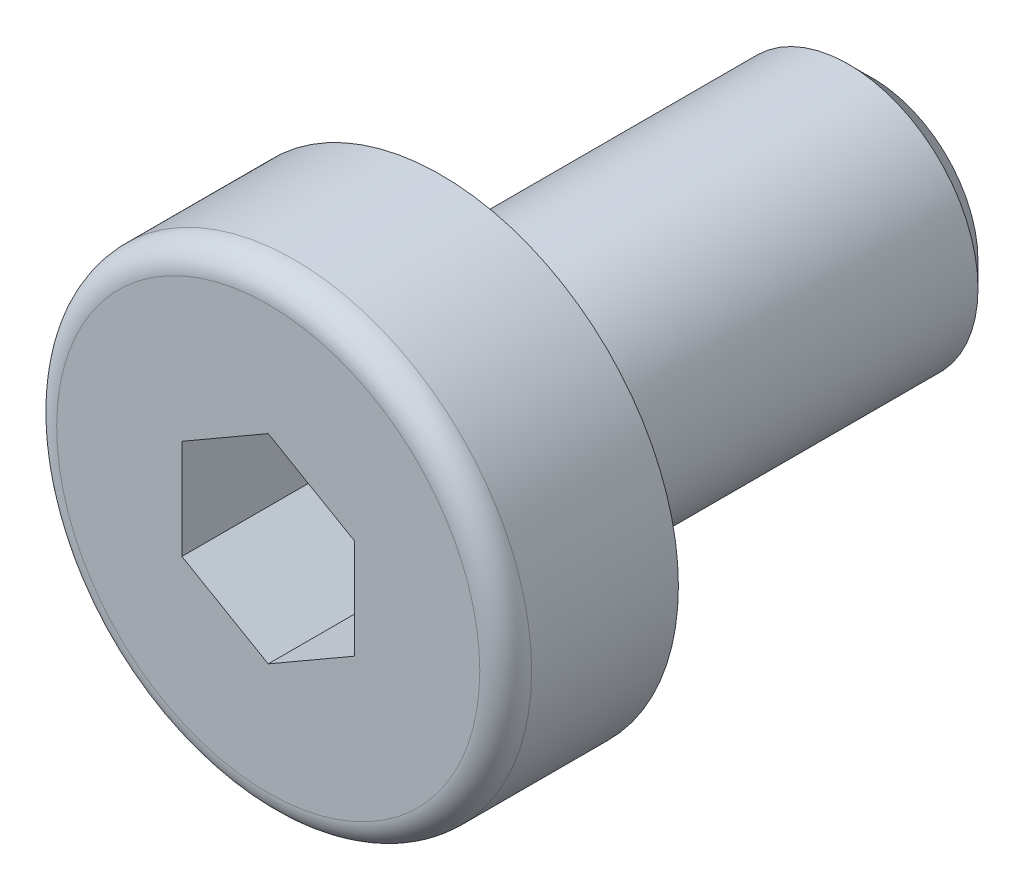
ISO-10303-21;
HEADER;
FILE_DESCRIPTION(('STEP AP214'),'2;1');
FILE_NAME('part.step','',(''),(''),'','','');
FILE_SCHEMA(('AUTOMOTIVE_DESIGN { 1 0 10303 214 1 1 1 1 }'));
ENDSEC;
DATA;
#1=APPLICATION_CONTEXT('core data for automotive mechanical design processes');
#2=APPLICATION_PROTOCOL_DEFINITION('international standard','automotive_design',2000,#1);
#3=PRODUCT_CONTEXT('',#1,'mechanical');
#4=PRODUCT('Part','Part','',(#3));
#5=PRODUCT_RELATED_PRODUCT_CATEGORY('part','',(#4));
#6=PRODUCT_DEFINITION_FORMATION('','',#4);
#7=PRODUCT_DEFINITION_CONTEXT('part definition',#1,'design');
#8=PRODUCT_DEFINITION('design','',#6,#7);
#9=PRODUCT_DEFINITION_SHAPE('','',#8);
#10=(LENGTH_UNIT() NAMED_UNIT(*) SI_UNIT(.MILLI.,.METRE.));
#11=(NAMED_UNIT(*) PLANE_ANGLE_UNIT() SI_UNIT($,.RADIAN.));
#12=(NAMED_UNIT(*) SI_UNIT($,.STERADIAN.) SOLID_ANGLE_UNIT());
#13=UNCERTAINTY_MEASURE_WITH_UNIT(LENGTH_MEASURE(1.E-05),#10,'distance_accuracy_value','');
#14=(GEOMETRIC_REPRESENTATION_CONTEXT(3) GLOBAL_UNCERTAINTY_ASSIGNED_CONTEXT((#13)) GLOBAL_UNIT_ASSIGNED_CONTEXT((#10,
#11,#12)) REPRESENTATION_CONTEXT('',''));
#15=CARTESIAN_POINT('',(0.,0.,0.));
#16=DIRECTION('',(0.,0.,1.));
#17=DIRECTION('',(1.,0.,0.));
#18=AXIS2_PLACEMENT_3D('',#15,#16,#17);
#19=CARTESIAN_POINT('',(56.0209250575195,73.9281135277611,11.9999999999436));
#20=DIRECTION('',(0.,0.,1.));
#21=DIRECTION('',(1.,0.,0.));
#22=AXIS2_PLACEMENT_3D('',#19,#20,#21);
#23=CONICAL_SURFACE('',#22,0.999999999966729,1.04719755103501);
#24=CARTESIAN_POINT('',(56.020925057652,73.9281135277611,11.422649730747));
#25=VERTEX_POINT('',#24);
#26=VERTEX_LOOP('',#25);
#27=FACE_BOUND('',#26,.T.);
#28=CARTESIAN_POINT('',(56.0209250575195,73.9281135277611,11.9999999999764));
#29=DIRECTION('',(0.,0.,1.));
#30=DIRECTION('',(1.,0.,0.));
#31=AXIS2_PLACEMENT_3D('',#28,#29,#30);
#32=CIRCLE('',#31,1.00000000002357);
#33=CARTESIAN_POINT('',(57.0209250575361,73.9281135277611,11.9999999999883));
#34=VERTEX_POINT('',#33);
#35=CARTESIAN_POINT('',(56.5209250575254,73.0620881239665,11.9999999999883));
#36=VERTEX_POINT('',#35);
#37=EDGE_CURVE('E102',#34,#36,#32,.F.);
#38=ORIENTED_EDGE('',*,*,#37,.F.);
#39=CARTESIAN_POINT('',(56.0209250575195,73.9281135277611,11.9999999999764));
#40=DIRECTION('',(0.,0.,1.));
#41=DIRECTION('',(1.,0.,0.));
#42=AXIS2_PLACEMENT_3D('',#39,#40,#41);
#43=CIRCLE('',#42,1.00000000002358);
#44=CARTESIAN_POINT('',(56.5209250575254,74.7941389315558,11.9999999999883));
#45=VERTEX_POINT('',#44);
#46=EDGE_CURVE('E105',#45,#34,#43,.F.);
#47=ORIENTED_EDGE('',*,*,#46,.F.);
#48=CARTESIAN_POINT('',(56.0209250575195,73.9281135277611,11.9999999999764));
#49=DIRECTION('',(0.,0.,1.));
#50=DIRECTION('',(1.,0.,0.));
#51=AXIS2_PLACEMENT_3D('',#48,#49,#50);
#52=CIRCLE('',#51,1.00000000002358);
#53=CARTESIAN_POINT('',(55.5209250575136,74.7941389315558,11.9999999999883));
#54=VERTEX_POINT('',#53);
#55=EDGE_CURVE('E129',#54,#45,#52,.F.);
#56=ORIENTED_EDGE('',*,*,#55,.F.);
#57=CARTESIAN_POINT('',(56.0209250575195,73.9281135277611,11.9999999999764));
#58=DIRECTION('',(0.,0.,1.));
#59=DIRECTION('',(1.,0.,0.));
#60=AXIS2_PLACEMENT_3D('',#57,#58,#59);
#61=CIRCLE('',#60,1.00000000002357);
#62=CARTESIAN_POINT('',(55.0209250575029,73.9281135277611,11.9999999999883));
#63=VERTEX_POINT('',#62);
#64=EDGE_CURVE('E236',#63,#54,#61,.F.);
#65=ORIENTED_EDGE('',*,*,#64,.F.);
#66=CARTESIAN_POINT('',(56.0209250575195,73.9281135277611,11.9999999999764));
#67=DIRECTION('',(0.,0.,1.));
#68=DIRECTION('',(1.,0.,0.));
#69=AXIS2_PLACEMENT_3D('',#66,#67,#68);
#70=CIRCLE('',#69,1.00000000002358);
#71=CARTESIAN_POINT('',(55.5209250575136,73.0620881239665,11.9999999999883));
#72=VERTEX_POINT('',#71);
#73=EDGE_CURVE('E239',#72,#63,#70,.F.);
#74=ORIENTED_EDGE('',*,*,#73,.F.);
#75=CARTESIAN_POINT('',(56.0209250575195,73.9281135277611,11.9999999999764));
#76=DIRECTION('',(0.,0.,1.));
#77=DIRECTION('',(1.,0.,0.));
#78=AXIS2_PLACEMENT_3D('',#75,#76,#77);
#79=CIRCLE('',#78,1.00000000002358);
#80=EDGE_CURVE('E108',#36,#72,#79,.F.);
#81=ORIENTED_EDGE('',*,*,#80,.F.);
#82=EDGE_LOOP('',(#38,#47,#56,#65,#74,#81));
#83=FACE_BOUND('',#82,.T.);
#84=ADVANCED_FACE('F17',(#27,#83),#23,.F.);
#85=CARTESIAN_POINT('',(57.0209250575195,74.5054637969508,12.0000000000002));
#86=DIRECTION('',(0.,0.,1.));
#87=DIRECTION('',(1.,0.,0.));
#88=AXIS2_PLACEMENT_3D('',#85,#86,#87);
#89=PLANE('',#88);
#90=DIRECTION('',(-0.866025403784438,-0.5,0.));
#91=VECTOR('',#90,1.);
#92=CARTESIAN_POINT('',(57.0209250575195,73.3507632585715,12.0000000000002));
#93=LINE('',#92,#91);
#94=CARTESIAN_POINT('',(57.0209250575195,73.3507632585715,12.0000000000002));
#95=VERTEX_POINT('',#94);
#96=EDGE_CURVE('E116',#95,#36,#93,.T.);
#97=ORIENTED_EDGE('',*,*,#96,.F.);
#98=DIRECTION('',(0.,1.,0.));
#99=VECTOR('',#98,1.);
#100=CARTESIAN_POINT('',(57.0209250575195,73.3507632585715,12.0000000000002));
#101=LINE('',#100,#99);
#102=EDGE_CURVE('E113',#95,#34,#101,.T.);
#103=ORIENTED_EDGE('',*,*,#102,.T.);
#104=ORIENTED_EDGE('',*,*,#37,.T.);
#105=EDGE_LOOP('',(#97,#103,#104));
#106=FACE_BOUND('',#105,.T.);
#107=ADVANCED_FACE('F114',(#106),#89,.T.);
#108=CARTESIAN_POINT('',(57.0209250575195,74.5054637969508,12.0000000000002));
#109=DIRECTION('',(0.,0.,1.));
#110=DIRECTION('',(1.,0.,0.));
#111=AXIS2_PLACEMENT_3D('',#108,#109,#110);
#112=PLANE('',#111);
#113=DIRECTION('',(-0.866025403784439,0.499999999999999,0.));
#114=VECTOR('',#113,1.);
#115=CARTESIAN_POINT('',(56.0209250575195,72.7734129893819,12.0000000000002));
#116=LINE('',#115,#114);
#117=CARTESIAN_POINT('',(56.0209250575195,72.7734129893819,12.0000000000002));
#118=VERTEX_POINT('',#117);
#119=EDGE_CURVE('E187',#118,#72,#116,.T.);
#120=ORIENTED_EDGE('',*,*,#119,.F.);
#121=DIRECTION('',(-0.866025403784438,-0.5,0.));
#122=VECTOR('',#121,1.);
#123=CARTESIAN_POINT('',(57.0209250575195,73.3507632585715,12.0000000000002));
#124=LINE('',#123,#122);
#125=EDGE_CURVE('E200',#36,#118,#124,.T.);
#126=ORIENTED_EDGE('',*,*,#125,.F.);
#127=ORIENTED_EDGE('',*,*,#80,.T.);
#128=EDGE_LOOP('',(#120,#126,#127));
#129=FACE_BOUND('',#128,.T.);
#130=ADVANCED_FACE('F362',(#129),#112,.T.);
#131=CARTESIAN_POINT('',(57.0209250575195,74.5054637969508,12.0000000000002));
#132=DIRECTION('',(0.,0.,1.));
#133=DIRECTION('',(1.,0.,0.));
#134=AXIS2_PLACEMENT_3D('',#131,#132,#133);
#135=PLANE('',#134);
#136=DIRECTION('',(0.,-1.,0.));
#137=VECTOR('',#136,1.);
#138=CARTESIAN_POINT('',(55.0209250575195,74.5054637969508,12.0000000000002));
#139=LINE('',#138,#137);
#140=CARTESIAN_POINT('',(55.0209250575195,73.3507632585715,12.0000000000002));
#141=VERTEX_POINT('',#140);
#142=EDGE_CURVE('E175',#63,#141,#139,.T.);
#143=ORIENTED_EDGE('',*,*,#142,.T.);
#144=DIRECTION('',(-0.866025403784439,0.499999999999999,0.));
#145=VECTOR('',#144,1.);
#146=CARTESIAN_POINT('',(56.0209250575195,72.7734129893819,12.0000000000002));
#147=LINE('',#146,#145);
#148=EDGE_CURVE('E176',#72,#141,#147,.T.);
#149=ORIENTED_EDGE('',*,*,#148,.F.);
#150=ORIENTED_EDGE('',*,*,#73,.T.);
#151=EDGE_LOOP('',(#143,#149,#150));
#152=FACE_BOUND('',#151,.T.);
#153=ADVANCED_FACE('F354',(#152),#135,.T.);
#154=CARTESIAN_POINT('',(57.0209250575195,74.5054637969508,12.0000000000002));
#155=DIRECTION('',(0.,0.,1.));
#156=DIRECTION('',(1.,0.,0.));
#157=AXIS2_PLACEMENT_3D('',#154,#155,#156);
#158=PLANE('',#157);
#159=DIRECTION('',(-0.866025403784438,-0.5,0.));
#160=VECTOR('',#159,1.);
#161=CARTESIAN_POINT('',(56.0209250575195,75.0828140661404,12.0000000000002));
#162=LINE('',#161,#160);
#163=CARTESIAN_POINT('',(55.0209250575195,74.5054637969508,12.0000000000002));
#164=VERTEX_POINT('',#163);
#165=EDGE_CURVE('E153',#54,#164,#162,.T.);
#166=ORIENTED_EDGE('',*,*,#165,.T.);
#167=DIRECTION('',(0.,-1.,0.));
#168=VECTOR('',#167,1.);
#169=CARTESIAN_POINT('',(55.0209250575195,74.5054637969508,12.0000000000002));
#170=LINE('',#169,#168);
#171=EDGE_CURVE('E172',#164,#63,#170,.T.);
#172=ORIENTED_EDGE('',*,*,#171,.T.);
#173=ORIENTED_EDGE('',*,*,#64,.T.);
#174=EDGE_LOOP('',(#166,#172,#173));
#175=FACE_BOUND('',#174,.T.);
#176=ADVANCED_FACE('F349',(#175),#158,.T.);
#177=CARTESIAN_POINT('',(57.0209250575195,74.5054637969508,12.0000000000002));
#178=DIRECTION('',(0.,0.,1.));
#179=DIRECTION('',(1.,0.,0.));
#180=AXIS2_PLACEMENT_3D('',#177,#178,#179);
#181=PLANE('',#180);
#182=DIRECTION('',(0.866025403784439,-0.499999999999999,0.));
#183=VECTOR('',#182,1.);
#184=CARTESIAN_POINT('',(56.0209250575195,75.0828140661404,12.0000000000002));
#185=LINE('',#184,#183);
#186=CARTESIAN_POINT('',(56.0209250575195,75.0828140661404,12.0000000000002));
#187=VERTEX_POINT('',#186);
#188=EDGE_CURVE('E146',#187,#45,#185,.T.);
#189=ORIENTED_EDGE('',*,*,#188,.F.);
#190=DIRECTION('',(-0.866025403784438,-0.5,0.));
#191=VECTOR('',#190,1.);
#192=CARTESIAN_POINT('',(56.0209250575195,75.0828140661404,12.0000000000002));
#193=LINE('',#192,#191);
#194=EDGE_CURVE('E150',#187,#54,#193,.T.);
#195=ORIENTED_EDGE('',*,*,#194,.T.);
#196=ORIENTED_EDGE('',*,*,#55,.T.);
#197=EDGE_LOOP('',(#189,#195,#196));
#198=FACE_BOUND('',#197,.T.);
#199=ADVANCED_FACE('F346',(#198),#181,.T.);
#200=CARTESIAN_POINT('',(57.0209250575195,74.5054637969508,12.0000000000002));
#201=DIRECTION('',(0.,0.,1.));
#202=DIRECTION('',(1.,0.,0.));
#203=AXIS2_PLACEMENT_3D('',#200,#201,#202);
#204=PLANE('',#203);
#205=DIRECTION('',(0.,1.,0.));
#206=VECTOR('',#205,1.);
#207=CARTESIAN_POINT('',(57.0209250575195,73.3507632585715,12.0000000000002));
#208=LINE('',#207,#206);
#209=CARTESIAN_POINT('',(57.0209250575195,74.5054637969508,12.0000000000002));
#210=VERTEX_POINT('',#209);
#211=EDGE_CURVE('E120',#34,#210,#208,.T.);
#212=ORIENTED_EDGE('',*,*,#211,.T.);
#213=DIRECTION('',(0.866025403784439,-0.499999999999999,0.));
#214=VECTOR('',#213,1.);
#215=CARTESIAN_POINT('',(56.0209250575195,75.0828140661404,12.0000000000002));
#216=LINE('',#215,#214);
#217=EDGE_CURVE('E127',#45,#210,#216,.T.);
#218=ORIENTED_EDGE('',*,*,#217,.F.);
#219=ORIENTED_EDGE('',*,*,#46,.T.);
#220=EDGE_LOOP('',(#212,#218,#219));
#221=FACE_BOUND('',#220,.T.);
#222=ADVANCED_FACE('F124',(#221),#204,.T.);
#223=CARTESIAN_POINT('',(57.0209250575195,73.3507632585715,12.0000000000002));
#224=DIRECTION('',(1.,0.,0.));
#225=DIRECTION('',(0.,1.,0.));
#226=AXIS2_PLACEMENT_3D('',#223,#224,#225);
#227=PLANE('',#226);
#228=DIRECTION('',(0.,0.,1.));
#229=VECTOR('',#228,1.);
#230=CARTESIAN_POINT('',(57.0209250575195,74.5054637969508,12.0000000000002));
#231=LINE('',#230,#229);
#232=CARTESIAN_POINT('',(57.0209250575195,74.5054637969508,13.5000000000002));
#233=VERTEX_POINT('',#232);
#234=EDGE_CURVE('E133',#210,#233,#231,.T.);
#235=ORIENTED_EDGE('',*,*,#234,.F.);
#236=ORIENTED_EDGE('',*,*,#211,.F.);
#237=ORIENTED_EDGE('',*,*,#102,.F.);
#238=DIRECTION('',(0.,0.,1.));
#239=VECTOR('',#238,1.);
#240=CARTESIAN_POINT('',(57.0209250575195,73.3507632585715,12.0000000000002));
#241=LINE('',#240,#239);
#242=CARTESIAN_POINT('',(57.0209250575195,73.3507632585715,13.5000000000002));
#243=VERTEX_POINT('',#242);
#244=EDGE_CURVE('E134',#243,#95,#241,.F.);
#245=ORIENTED_EDGE('',*,*,#244,.F.);
#246=DIRECTION('',(0.,1.,0.));
#247=VECTOR('',#246,1.);
#248=CARTESIAN_POINT('',(57.0209250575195,73.9281135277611,13.5000000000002));
#249=LINE('',#248,#247);
#250=EDGE_CURVE('E214',#233,#243,#249,.F.);
#251=ORIENTED_EDGE('',*,*,#250,.F.);
#252=EDGE_LOOP('',(#235,#236,#237,#245,#251));
#253=FACE_BOUND('',#252,.T.);
#254=ADVANCED_FACE('F131',(#253),#227,.F.);
#255=CARTESIAN_POINT('',(57.0209250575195,73.3507632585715,12.0000000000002));
#256=DIRECTION('',(-0.5,0.866025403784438,0.));
#257=DIRECTION('',(-0.866025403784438,-0.5,0.));
#258=AXIS2_PLACEMENT_3D('',#255,#256,#257);
#259=PLANE('',#258);
#260=ORIENTED_EDGE('',*,*,#125,.T.);
#261=DIRECTION('',(0.,0.,1.));
#262=VECTOR('',#261,1.);
#263=CARTESIAN_POINT('',(56.0209250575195,72.7734129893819,12.0000000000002));
#264=LINE('',#263,#262);
#265=CARTESIAN_POINT('',(56.0209250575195,72.7734129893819,13.5000000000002));
#266=VERTEX_POINT('',#265);
#267=EDGE_CURVE('E195',#266,#118,#264,.F.);
#268=ORIENTED_EDGE('',*,*,#267,.F.);
#269=DIRECTION('',(-0.866025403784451,-0.499999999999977,0.));
#270=VECTOR('',#269,1.);
#271=CARTESIAN_POINT('',(57.0209250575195,73.3507632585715,13.5000000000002));
#272=LINE('',#271,#270);
#273=EDGE_CURVE('E209',#243,#266,#272,.T.);
#274=ORIENTED_EDGE('',*,*,#273,.F.);
#275=ORIENTED_EDGE('',*,*,#244,.T.);
#276=ORIENTED_EDGE('',*,*,#96,.T.);
#277=EDGE_LOOP('',(#260,#268,#274,#275,#276));
#278=FACE_BOUND('',#277,.T.);
#279=ADVANCED_FACE('F364',(#278),#259,.T.);
#280=CARTESIAN_POINT('',(56.0209250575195,72.7734129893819,12.0000000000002));
#281=DIRECTION('',(0.499999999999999,0.866025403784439,0.));
#282=DIRECTION('',(-0.866025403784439,0.499999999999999,0.));
#283=AXIS2_PLACEMENT_3D('',#280,#281,#282);
#284=PLANE('',#283);
#285=ORIENTED_EDGE('',*,*,#148,.T.);
#286=DIRECTION('',(0.,0.,1.));
#287=VECTOR('',#286,1.);
#288=CARTESIAN_POINT('',(55.0209250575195,73.3507632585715,12.0000000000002));
#289=LINE('',#288,#287);
#290=CARTESIAN_POINT('',(55.0209250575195,73.3507632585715,13.5000000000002));
#291=VERTEX_POINT('',#290);
#292=EDGE_CURVE('E154',#141,#291,#289,.T.);
#293=ORIENTED_EDGE('',*,*,#292,.T.);
#294=DIRECTION('',(-0.866025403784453,0.499999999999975,0.));
#295=VECTOR('',#294,1.);
#296=CARTESIAN_POINT('',(56.0209250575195,72.7734129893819,13.5000000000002));
#297=LINE('',#296,#295);
#298=EDGE_CURVE('E206',#266,#291,#297,.T.);
#299=ORIENTED_EDGE('',*,*,#298,.F.);
#300=ORIENTED_EDGE('',*,*,#267,.T.);
#301=ORIENTED_EDGE('',*,*,#119,.T.);
#302=EDGE_LOOP('',(#285,#293,#299,#300,#301));
#303=FACE_BOUND('',#302,.T.);
#304=ADVANCED_FACE('F359',(#303),#284,.T.);
#305=CARTESIAN_POINT('',(55.0209250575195,74.5054637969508,12.0000000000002));
#306=DIRECTION('',(-1.,0.,0.));
#307=DIRECTION('',(0.,-1.,0.));
#308=AXIS2_PLACEMENT_3D('',#305,#306,#307);
#309=PLANE('',#308);
#310=ORIENTED_EDGE('',*,*,#292,.F.);
#311=ORIENTED_EDGE('',*,*,#142,.F.);
#312=ORIENTED_EDGE('',*,*,#171,.F.);
#313=DIRECTION('',(0.,0.,1.));
#314=VECTOR('',#313,1.);
#315=CARTESIAN_POINT('',(55.0209250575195,74.5054637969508,12.0000000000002));
#316=LINE('',#315,#314);
#317=CARTESIAN_POINT('',(55.0209250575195,74.5054637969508,13.5000000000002));
#318=VERTEX_POINT('',#317);
#319=EDGE_CURVE('E147',#164,#318,#316,.T.);
#320=ORIENTED_EDGE('',*,*,#319,.T.);
#321=DIRECTION('',(0.,1.,0.));
#322=VECTOR('',#321,1.);
#323=CARTESIAN_POINT('',(55.0209250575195,73.9281135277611,13.5000000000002));
#324=LINE('',#323,#322);
#325=EDGE_CURVE('E166',#291,#318,#324,.T.);
#326=ORIENTED_EDGE('',*,*,#325,.F.);
#327=EDGE_LOOP('',(#310,#311,#312,#320,#326));
#328=FACE_BOUND('',#327,.T.);
#329=ADVANCED_FACE('F356',(#328),#309,.F.);
#330=CARTESIAN_POINT('',(56.0209250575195,75.0828140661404,12.0000000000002));
#331=DIRECTION('',(-0.5,0.866025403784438,0.));
#332=DIRECTION('',(-0.866025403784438,-0.5,0.));
#333=AXIS2_PLACEMENT_3D('',#330,#331,#332);
#334=PLANE('',#333);
#335=ORIENTED_EDGE('',*,*,#319,.F.);
#336=ORIENTED_EDGE('',*,*,#165,.F.);
#337=ORIENTED_EDGE('',*,*,#194,.F.);
#338=DIRECTION('',(0.,0.,1.));
#339=VECTOR('',#338,1.);
#340=CARTESIAN_POINT('',(56.0209250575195,75.0828140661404,12.0000000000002));
#341=LINE('',#340,#339);
#342=CARTESIAN_POINT('',(56.0209250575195,75.0828140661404,13.5000000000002));
#343=VERTEX_POINT('',#342);
#344=EDGE_CURVE('E143',#343,#187,#341,.F.);
#345=ORIENTED_EDGE('',*,*,#344,.F.);
#346=DIRECTION('',(0.866025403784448,0.499999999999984,0.));
#347=VECTOR('',#346,1.);
#348=CARTESIAN_POINT('',(55.0209250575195,74.5054637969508,13.5000000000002));
#349=LINE('',#348,#347);
#350=EDGE_CURVE('E161',#318,#343,#349,.T.);
#351=ORIENTED_EDGE('',*,*,#350,.F.);
#352=EDGE_LOOP('',(#335,#336,#337,#345,#351));
#353=FACE_BOUND('',#352,.T.);
#354=ADVANCED_FACE('F342',(#353),#334,.F.);
#355=CARTESIAN_POINT('',(56.0209250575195,75.0828140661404,12.0000000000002));
#356=DIRECTION('',(-0.499999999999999,-0.866025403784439,0.));
#357=DIRECTION('',(0.866025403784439,-0.499999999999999,0.));
#358=AXIS2_PLACEMENT_3D('',#355,#356,#357);
#359=PLANE('',#358);
#360=ORIENTED_EDGE('',*,*,#217,.T.);
#361=ORIENTED_EDGE('',*,*,#234,.T.);
#362=DIRECTION('',(0.866025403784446,-0.499999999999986,0.));
#363=VECTOR('',#362,1.);
#364=CARTESIAN_POINT('',(56.0209250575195,75.0828140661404,13.5000000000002));
#365=LINE('',#364,#363);
#366=EDGE_CURVE('E157',#343,#233,#365,.T.);
#367=ORIENTED_EDGE('',*,*,#366,.F.);
#368=ORIENTED_EDGE('',*,*,#344,.T.);
#369=ORIENTED_EDGE('',*,*,#188,.T.);
#370=EDGE_LOOP('',(#360,#361,#367,#368,#369));
#371=FACE_BOUND('',#370,.T.);
#372=ADVANCED_FACE('F335',(#371),#359,.T.);
#373=CARTESIAN_POINT('',(56.0209250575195,73.9281135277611,13.5000000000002));
#374=DIRECTION('',(0.,0.,1.));
#375=DIRECTION('',(1.,0.,0.));
#376=AXIS2_PLACEMENT_3D('',#373,#374,#375);
#377=PLANE('',#376);
#378=CARTESIAN_POINT('',(56.0209250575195,73.9281135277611,13.5000000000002));
#379=DIRECTION('',(0.,0.,-1.));
#380=DIRECTION('',(-1.,0.,0.));
#381=AXIS2_PLACEMENT_3D('',#378,#379,#380);
#382=CIRCLE('',#381,2.45000000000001);
#383=CARTESIAN_POINT('',(53.5709250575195,73.9281135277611,13.5000000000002));
#384=VERTEX_POINT('',#383);
#385=CARTESIAN_POINT('',(58.4709250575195,73.9281135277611,13.5000000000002));
#386=VERTEX_POINT('',#385);
#387=EDGE_CURVE('E160',#384,#386,#382,.T.);
#388=ORIENTED_EDGE('',*,*,#387,.F.);
#389=CARTESIAN_POINT('',(56.0209250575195,73.9281135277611,13.5000000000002));
#390=DIRECTION('',(0.,0.,-1.));
#391=DIRECTION('',(1.,0.,0.));
#392=AXIS2_PLACEMENT_3D('',#389,#390,#391);
#393=CIRCLE('',#392,2.45);
#394=EDGE_CURVE('E400',#386,#384,#393,.T.);
#395=ORIENTED_EDGE('',*,*,#394,.F.);
#396=EDGE_LOOP('',(#388,#395));
#397=FACE_BOUND('',#396,.T.);
#398=ORIENTED_EDGE('',*,*,#350,.T.);
#399=ORIENTED_EDGE('',*,*,#366,.T.);
#400=ORIENTED_EDGE('',*,*,#250,.T.);
#401=ORIENTED_EDGE('',*,*,#273,.T.);
#402=ORIENTED_EDGE('',*,*,#298,.T.);
#403=ORIENTED_EDGE('',*,*,#325,.T.);
#404=EDGE_LOOP('',(#398,#399,#400,#401,#402,#403));
#405=FACE_BOUND('',#404,.T.);
#406=ADVANCED_FACE('F311',(#397,#405),#377,.T.);
#407=CARTESIAN_POINT('',(56.0209250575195,73.9281135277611,13.2000000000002));
#408=DIRECTION('',(0.,0.,1.));
#409=DIRECTION('',(1.,0.,0.));
#410=AXIS2_PLACEMENT_3D('',#407,#408,#409);
#411=TOROIDAL_SURFACE('',#410,2.45,0.3);
#412=CARTESIAN_POINT('',(56.0209250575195,73.9281135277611,13.2000000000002));
#413=DIRECTION('',(0.,0.,1.));
#414=DIRECTION('',(1.,0.,0.));
#415=AXIS2_PLACEMENT_3D('',#412,#413,#414);
#416=CIRCLE('',#415,2.75);
#417=CARTESIAN_POINT('',(58.7709250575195,73.9281135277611,13.2000000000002));
#418=VERTEX_POINT('',#417);
#419=EDGE_CURVE('E304',#418,#418,#416,.F.);
#420=ORIENTED_EDGE('',*,*,#419,.F.);
#421=EDGE_LOOP('',(#420));
#422=FACE_BOUND('',#421,.T.);
#423=ORIENTED_EDGE('',*,*,#394,.T.);
#424=ORIENTED_EDGE('',*,*,#387,.T.);
#425=EDGE_LOOP('',(#423,#424));
#426=FACE_BOUND('',#425,.T.);
#427=ADVANCED_FACE('F306',(#422,#426),#411,.T.);
#428=CARTESIAN_POINT('',(56.0209250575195,73.9281135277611,45.25));
#429=DIRECTION('',(0.,0.,1.));
#430=DIRECTION('',(1.,0.,0.));
#431=AXIS2_PLACEMENT_3D('',#428,#429,#430);
#432=CYLINDRICAL_SURFACE('',#431,2.75);
#433=CARTESIAN_POINT('',(56.0209250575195,73.9281135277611,11.5000000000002));
#434=DIRECTION('',(0.,0.,1.));
#435=DIRECTION('',(1.,0.,0.));
#436=AXIS2_PLACEMENT_3D('',#433,#434,#435);
#437=CIRCLE('',#436,2.75);
#438=CARTESIAN_POINT('',(58.7709250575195,73.9281135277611,11.5000000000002));
#439=VERTEX_POINT('',#438);
#440=EDGE_CURVE('E232',#439,#439,#437,.F.);
#441=ORIENTED_EDGE('',*,*,#440,.F.);
#442=EDGE_LOOP('',(#441));
#443=FACE_BOUND('',#442,.T.);
#444=ORIENTED_EDGE('',*,*,#419,.T.);
#445=EDGE_LOOP('',(#444));
#446=FACE_BOUND('',#445,.T.);
#447=ADVANCED_FACE('F310',(#443,#446),#432,.T.);
#448=CARTESIAN_POINT('',(56.0209250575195,75.1476135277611,6.50000000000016));
#449=DIRECTION('',(0.,0.,-1.));
#450=DIRECTION('',(-1.,0.,0.));
#451=AXIS2_PLACEMENT_3D('',#448,#449,#450);
#452=PLANE('',#451);
#453=CARTESIAN_POINT('',(56.0209250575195,73.9281135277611,6.49999999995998));
#454=DIRECTION('',(0.,0.,1.));
#455=DIRECTION('',(1.,0.,0.));
#456=AXIS2_PLACEMENT_3D('',#453,#454,#455);
#457=CIRCLE('',#456,1.21950000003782);
#458=CARTESIAN_POINT('',(57.2404250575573,73.9281135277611,6.49999999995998));
#459=VERTEX_POINT('',#458);
#460=EDGE_CURVE('E228',#459,#459,#457,.T.);
#461=ORIENTED_EDGE('',*,*,#460,.F.);
#462=EDGE_LOOP('',(#461));
#463=FACE_BOUND('',#462,.T.);
#464=ADVANCED_FACE('F280',(#463),#452,.T.);
#465=CARTESIAN_POINT('',(56.0209250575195,76.6781135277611,11.5000000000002));
#466=DIRECTION('',(0.,0.,-1.));
#467=DIRECTION('',(-1.,0.,0.));
#468=AXIS2_PLACEMENT_3D('',#465,#466,#467);
#469=PLANE('',#468);
#470=ORIENTED_EDGE('',*,*,#440,.T.);
#471=EDGE_LOOP('',(#470));
#472=FACE_BOUND('',#471,.T.);
#473=CARTESIAN_POINT('',(56.0209250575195,73.9281135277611,11.5000000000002));
#474=DIRECTION('',(0.,0.,-1.));
#475=DIRECTION('',(1.,0.,0.));
#476=AXIS2_PLACEMENT_3D('',#473,#474,#475);
#477=CIRCLE('',#476,1.6);
#478=CARTESIAN_POINT('',(54.4209250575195,73.9281135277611,11.5000000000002));
#479=VERTEX_POINT('',#478);
#480=CARTESIAN_POINT('',(57.6209250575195,73.9281135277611,11.5000000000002));
#481=VERTEX_POINT('',#480);
#482=EDGE_CURVE('E231',#479,#481,#477,.F.);
#483=ORIENTED_EDGE('',*,*,#482,.T.);
#484=CARTESIAN_POINT('',(56.0209250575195,73.9281135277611,11.5000000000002));
#485=DIRECTION('',(0.,0.,-1.));
#486=DIRECTION('',(-1.,0.,0.));
#487=AXIS2_PLACEMENT_3D('',#484,#485,#486);
#488=CIRCLE('',#487,1.6);
#489=EDGE_CURVE('E36',#481,#479,#488,.F.);
#490=ORIENTED_EDGE('',*,*,#489,.T.);
#491=EDGE_LOOP('',(#483,#490));
#492=FACE_BOUND('',#491,.T.);
#493=ADVANCED_FACE('F271',(#472,#492),#469,.T.);
#494=CARTESIAN_POINT('',(56.0209250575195,73.9281135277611,6.78049999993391));
#495=DIRECTION('',(0.,0.,1.));
#496=DIRECTION('',(1.,0.,0.));
#497=AXIS2_PLACEMENT_3D('',#494,#495,#496);
#498=CONICAL_SURFACE('',#497,1.50000000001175,0.785398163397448);
#499=ORIENTED_EDGE('',*,*,#460,.T.);
#500=EDGE_LOOP('',(#499));
#501=FACE_BOUND('',#500,.T.);
#502=CARTESIAN_POINT('',(56.0209250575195,73.9281135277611,6.78050000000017));
#503=DIRECTION('',(0.,0.,1.));
#504=DIRECTION('',(1.,0.,0.));
#505=AXIS2_PLACEMENT_3D('',#502,#503,#504);
#506=CIRCLE('',#505,1.5);
#507=CARTESIAN_POINT('',(57.5209250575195,73.9281135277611,6.78050000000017));
#508=VERTEX_POINT('',#507);
#509=EDGE_CURVE('E28',#508,#508,#506,.T.);
#510=ORIENTED_EDGE('',*,*,#509,.F.);
#511=EDGE_LOOP('',(#510));
#512=FACE_BOUND('',#511,.T.);
#513=ADVANCED_FACE('F258',(#501,#512),#498,.T.);
#514=CARTESIAN_POINT('',(56.0209250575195,73.9281135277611,11.4000000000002));
#515=DIRECTION('',(0.,0.,-1.));
#516=DIRECTION('',(-1.,0.,0.));
#517=AXIS2_PLACEMENT_3D('',#514,#515,#516);
#518=TOROIDAL_SURFACE('',#517,1.6,0.1);
#519=CARTESIAN_POINT('',(56.0209250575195,73.9281135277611,11.4000000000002));
#520=DIRECTION('',(0.,0.,1.));
#521=DIRECTION('',(1.,0.,0.));
#522=AXIS2_PLACEMENT_3D('',#519,#520,#521);
#523=CIRCLE('',#522,1.5);
#524=CARTESIAN_POINT('',(57.5209250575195,73.9281135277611,11.4000000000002));
#525=VERTEX_POINT('',#524);
#526=EDGE_CURVE('E10',#525,#525,#523,.F.);
#527=ORIENTED_EDGE('',*,*,#526,.F.);
#528=EDGE_LOOP('',(#527));
#529=FACE_BOUND('',#528,.T.);
#530=ORIENTED_EDGE('',*,*,#482,.F.);
#531=ORIENTED_EDGE('',*,*,#489,.F.);
#532=EDGE_LOOP('',(#530,#531));
#533=FACE_BOUND('',#532,.T.);
#534=ADVANCED_FACE('F246',(#529,#533),#518,.F.);
#535=CARTESIAN_POINT('',(56.0209250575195,73.9281135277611,45.25));
#536=DIRECTION('',(0.,0.,1.));
#537=DIRECTION('',(1.,0.,0.));
#538=AXIS2_PLACEMENT_3D('',#535,#536,#537);
#539=CYLINDRICAL_SURFACE('',#538,1.5);
#540=ORIENTED_EDGE('',*,*,#509,.T.);
#541=EDGE_LOOP('',(#540));
#542=FACE_BOUND('',#541,.T.);
#543=ORIENTED_EDGE('',*,*,#526,.T.);
#544=EDGE_LOOP('',(#543));
#545=FACE_BOUND('',#544,.T.);
#546=ADVANCED_FACE('F257',(#542,#545),#539,.T.);
#547=CLOSED_SHELL('',(#84,#107,#130,#153,#176,#199,#222,#254,#279,#304,#329,#354,#372,#406,#427,
#447,#464,#493,#513,#534,#546));
#548=MANIFOLD_SOLID_BREP('B1',#547);
#549=ADVANCED_BREP_SHAPE_REPRESENTATION('',(#18,#548),#14);
#550=SHAPE_DEFINITION_REPRESENTATION(#9,#549);
ENDSEC;
END-ISO-10303-21;
